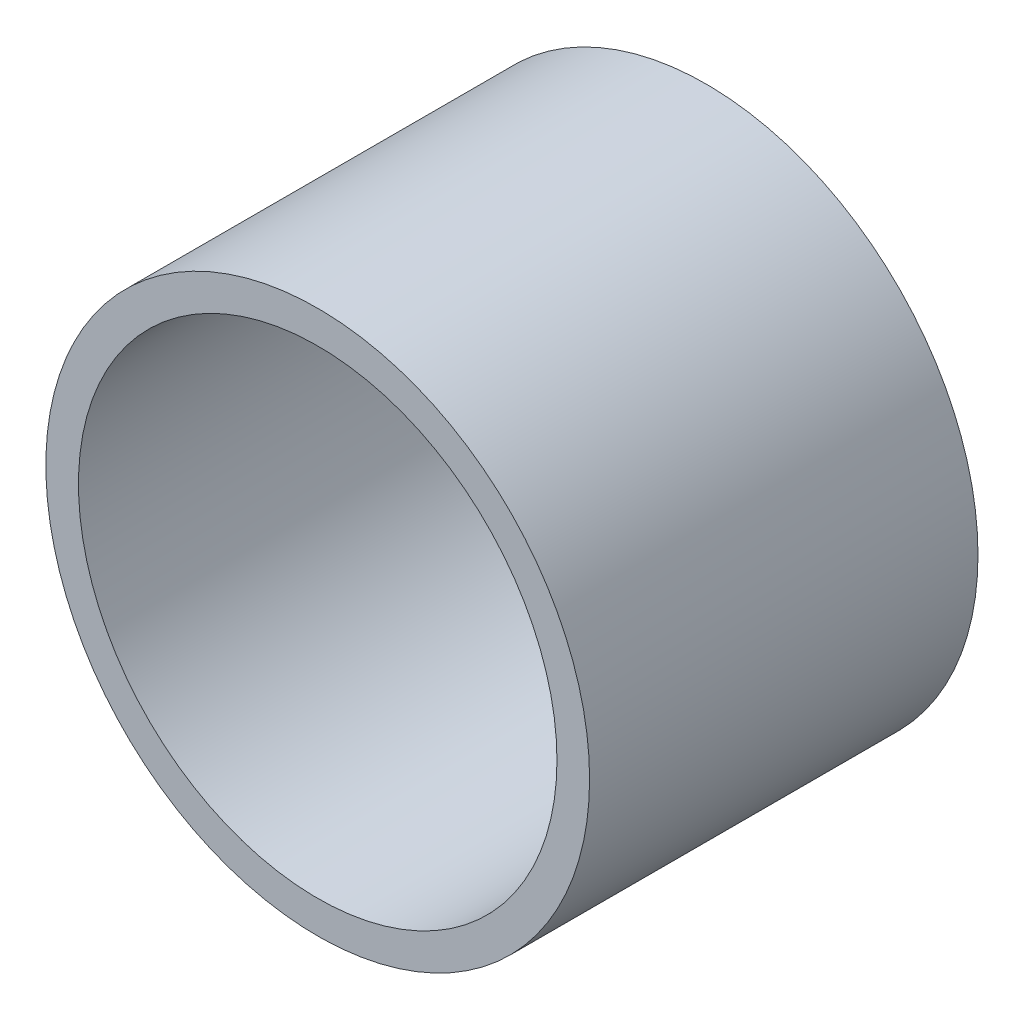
from build123d import *

# Parameters (mm, degrees)
SKETCH1_R           = 4.445
SKETCH1_R_2         = 3.9116
BOSS_EXTRUDE1_DEPTH = 6.35


with BuildPart() as part:
    # Sketch1 → Boss-Extrude1 (new body)
    with BuildSketch(Plane.XY):
        Circle(SKETCH1_R)
        Circle(SKETCH1_R_2, mode=Mode.SUBTRACT)
    extrude(amount=BOSS_EXTRUDE1_DEPTH)


solid = part.part
